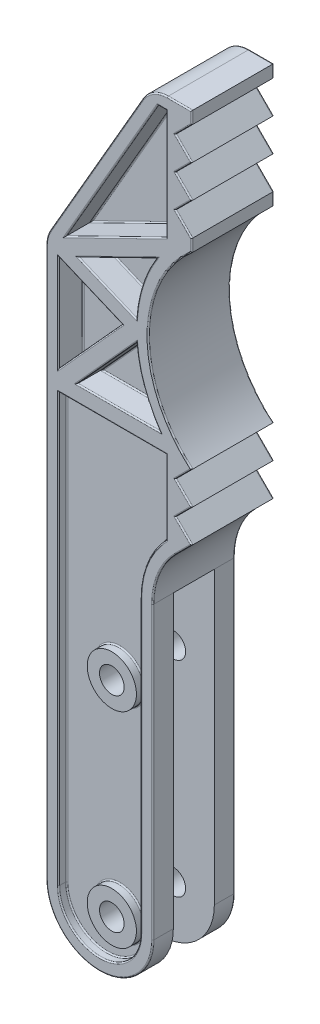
from build123d import *

# Parameters (mm, degrees)
SKETCH1_R           = 1.5000000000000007
SKETCH1_R_2         = 1.5000000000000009
BOSS_EXTRUDE1_DEPTH = 5
CUT_EXTRUDE1_DEPTH  = 2.5
CUT_EXTRUDE2_DEPTH  = 1
SKETCH4_R           = 3.000000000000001
SKETCH4_R_2         = 1.5000000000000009
SKETCH4_R_3         = 1.5000000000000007
EXTRUDE_THIN1_DEPTH = 1
CUT_EXTRUDE3_DEPTH  = 2
EXTRUDE_THIN3_REACH = 94.277
BOSS_EXTRUDE2_DEPTH = 3
FILLET1_R           = 3.5
FILLET2_R           = 0.15


with BuildPart() as part:
    # Sketch1 → Boss-Extrude1 (new, symmetric)
    with BuildSketch(Plane.XY):
        with BuildLine():
            Line((0, 88.5), (-2.000000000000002, 86.5))
            Line((-2.000000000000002, 86.5), (0, 84.49999999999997))
            Line((0, 84.49999999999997), (-1.99999999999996, 82.49999999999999))
            Line((-1.99999999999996, 82.49999999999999), (4.19e-14, 80.49999999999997))
            Line((4.19e-14, 80.49999999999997), (-1.9999999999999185, 78.49999999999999))
            Line((-1.9999999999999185, 78.49999999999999), (8.38e-14, 76.49999999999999))
            Line((8.38e-14, 76.49999999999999), (0, 75))
            ThreePointArc((0, 75), (-5.3099277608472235, 63.54999999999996), (8.38e-14, 52.10000000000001))
            Line((8.38e-14, 52.10000000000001), (-1.9999999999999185, 50.10000000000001))
            Line((-1.9999999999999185, 50.10000000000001), (4.19e-14, 48.100000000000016))
            Line((4.19e-14, 48.100000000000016), (-1.99999999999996, 46.1))
            Line((-1.99999999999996, 46.1), (0, 44.100000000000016))
            Line((0, 44.100000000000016), (-2.000000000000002, 42.1))
            ThreePointArc((-2.000000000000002, 42.1), (-4.035298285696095, 39.05396085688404), (-4.749999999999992, 35.460912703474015))
            Line((-4.749999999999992, 35.460912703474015), (-4.749999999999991, 0))
            ThreePointArc((-4.749999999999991, 0), (-11.249999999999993, -6.499999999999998), (-17.74999999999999, 0))
            Line((-17.74999999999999, 0), (-17.75, 67.91635220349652))
            Line((-17.75, 67.91635220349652), (-5.000000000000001, 90))
            Line((-5.000000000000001, 90), (0, 90))
            Line((0, 90), (0, 88.5))
        make_face()
        with Locations((-9.749999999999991, 0)):
            Circle(SKETCH1_R, mode=Mode.SUBTRACT)
        with Locations((-9.749999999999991, 25)):
            Circle(SKETCH1_R_2, mode=Mode.SUBTRACT)
    extrude(amount=BOSS_EXTRUDE1_DEPTH, both=True)

    # Sketch2 → Cut-Extrude1 (cut, symmetric)
    with BuildSketch(Plane.XY):
        with BuildLine():
            Line((-14.999999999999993, -8.410797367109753), (-14.999999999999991, 23.58920263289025))
            ThreePointArc((-14.999999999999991, 23.58920263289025), (-12.082951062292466, 31.43139620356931), (-4.749999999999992, 35.460912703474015))
            Line((-4.749999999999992, 35.460912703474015), (-4.749999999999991, 0))
            Line((-4.749999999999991, 0), (-4.74999999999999, -8.410797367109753))
            Line((-4.74999999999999, -8.410797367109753), (-14.999999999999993, -8.410797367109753))
        make_face()
    extrude(amount=CUT_EXTRUDE1_DEPTH, both=True, mode=Mode.SUBTRACT)

    # Sketch3 → Cut-Extrude2 (cut)
    with BuildSketch(Plane.XY.offset(5)):
        with BuildLine():
            Line((-3.127647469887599, 88.5), (-4.13397459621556, 88.5))
            Line((-4.13397459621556, 88.5), (-16.249999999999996, 67.51442841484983))
            Line((-16.249999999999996, 67.51442841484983), (-16.249999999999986, 0))
            ThreePointArc((-16.249999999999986, 0), (-11.24999999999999, -4.999999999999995), (-6.249999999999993, 7.2e-16))
            Line((-6.249999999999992, 6.1e-16), (-6.249999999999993, 35.460912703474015))
            ThreePointArc((-6.249999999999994, 35.460912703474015), (-5.439227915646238, 39.583992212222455), (-3.127647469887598, 43.09308495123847))
            Line((-3.127647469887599, 43.09308495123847), (-3.127647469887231, 53.15980936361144))
            ThreePointArc((-3.127647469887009, 53.159809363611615), (-6.809927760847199, 63.549999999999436), (-3.127647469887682, 73.9401906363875))
            Line((-3.1276474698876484, 73.94019063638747), (-3.127647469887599, 88.5))
        make_face()
    cut_extrude2 = extrude(amount=-CUT_EXTRUDE2_DEPTH, mode=Mode.SUBTRACT)

    # Sketch4 → Extrude-Thin1 (add)
    # profile 1 of 2: a face of its own
    with BuildSketch(Plane.XY.offset(4)):
        with Locations((-9.749999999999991, 25)):
            Circle(SKETCH4_R)
        with Locations((-9.749999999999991, 25)):
            Circle(SKETCH4_R_2, mode=Mode.SUBTRACT)
    # profile 2 of 2: a face of its own
    with BuildSketch(Plane.XY.offset(4)):
        with Locations((-9.749999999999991, 0)):
            Circle(SKETCH4_R)
        with Locations((-9.749999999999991, 0)):
            Circle(SKETCH4_R_3, mode=Mode.SUBTRACT)
    extrude_thin1 = extrude(amount=EXTRUDE_THIN1_DEPTH)

    # Sketch5 → Cut-Extrude3 (cut)
    with BuildSketch(Plane.XY.offset(4)):
        with BuildLine():
            Line((-16.25, 53.159809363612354), (-3.127647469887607, 53.159809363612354))
            ThreePointArc((-3.1276474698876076, 53.159809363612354), (-6.809927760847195, 63.54999999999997), (-3.127647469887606, 73.94019063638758))
            Line((-3.1276474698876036, 73.94019063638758), (-3.127647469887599, 88.5))
            Line((-3.127647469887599, 88.5), (-4.13397459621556, 88.5))
            Line((-4.13397459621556, 88.5), (-16.250000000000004, 67.51442841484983))
            Line((-16.250000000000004, 67.51442841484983), (-16.25, 53.159809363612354))
        make_face()
    cut_extrude3 = extrude(amount=-CUT_EXTRUDE3_DEPTH, mode=Mode.SUBTRACT)

    # Sketch7 → Extrude-Thin3 (add, up to next)
    with BuildSketch(Plane.XY.offset(5), mode=Mode.PRIVATE) as extrude_thin3_sk1:
        Polygon((-3.5674314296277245, 74.83829423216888), (-18.66641219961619, 67.44461539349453), (-8.501155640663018, 63.17564044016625), (-18.509657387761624, 52.159809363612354), (-3.1276474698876, 52.159809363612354), (-3.1276474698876, 54.159809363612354), (-13.990342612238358, 54.159809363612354), (-5.118699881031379, 63.92435955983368), (-13.833587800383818, 67.58424143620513), (-2.6878635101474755, 73.04208704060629), align=None)
    extrude_thin3_tool1 = extrude(extrude_thin3_sk1.sketch, amount=-EXTRUDE_THIN3_REACH, mode=Mode.PRIVATE) - part.part
    extrude_thin3 = extrude_thin3_tool1.solids().sort_by_distance((-10.994916, 70.892301, 5))[0]
    add(extrude_thin3)

    # Sketch8 → Boss-Extrude2 (add)
    with BuildSketch(Plane.XY.offset(5)):
        Polygon((-3.567431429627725, 74.83829423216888), (-3.127647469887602, 73.94019063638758), (-3.127647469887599, 75.0536479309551), align=None)
    boss_extrude2 = extrude(amount=-BOSS_EXTRUDE2_DEPTH)

    # Mirror2: Cut-Extrude2, Extrude-Thin1, Cut-Extrude3, Extrude-Thin3, Boss-Extrude2 across plane
    add(cut_extrude2.mirror(Plane.XY), mode=Mode.SUBTRACT)
    add(extrude_thin1.mirror(Plane.XY))
    add(cut_extrude3.mirror(Plane.XY), mode=Mode.SUBTRACT)
    add(extrude_thin3.mirror(Plane.XY))
    add(boss_extrude2.mirror(Plane.XY))

    # Fillet1
    fillet1_edges = [part.edges().sort_by_distance(p)[0] for p in [
        (-17.75, 67.91635220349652, 0),
        (-5.000000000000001, 90, 0),
    ]]
    fillet(fillet1_edges, radius=FILLET1_R)

    # Fillet2
    fillet2_edges = [part.edges().sort_by_distance(p)[0] for p in [
        (-12.749999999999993, 25, 4),
        (-12.749999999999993, -9.6e-16, 4),
        (-11.24999999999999, -6.499999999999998, 5),
        (-9.743869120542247, 78.7833776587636, 2),
        (-3.6308110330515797, 88.5, 2),
        (-5.833301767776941, 57.95760700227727, 2),
        (-6.025807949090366, 68.57604316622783, 2),
        (-16.250000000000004, 60.538360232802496, 2),
        (-4.749999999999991, 17.730456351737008, 5),
        (-16.249999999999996, 60.53836023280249, 5),
        (-16.24999999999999, 26.079904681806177, 5),
        (-16.24999999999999, 26.079904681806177, 4),
        (-3.1276474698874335, 47.62644715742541, 5),
        (-3.1276474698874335, 47.62644715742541, 4),
        (-6.025807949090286, 68.57604316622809, 5),
        (-5.833301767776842, 57.95760700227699, 5),
        (-9.087085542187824, 69.90851178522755, 2),
        (-10.304391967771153, 66.10212944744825, 2),
        (-10.369538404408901, 58.145037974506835, 2),
        (-8.933834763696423, 54.159809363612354, 2),
        (-9.6888237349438, 52.159809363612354, 4),
        (0, 89.25, -5),
        (-9.688823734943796, 52.159809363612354, 5),
        (-12.375577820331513, 58.91126787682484, 1.9999999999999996),
        (-12.375577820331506, 58.911267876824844, 5),
        (-12.375577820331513, 64.80273279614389, 1.9999999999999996),
        (-12.375577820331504, 64.8027327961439, 5),
        (-9.240705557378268, 72.06020162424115, 5),
        (-9.240705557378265, 72.06020162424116, 2),
        (-8.933834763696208, 54.159809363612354, 5),
        (-10.369538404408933, 58.1450379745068, 5),
        (-10.30439196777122, 66.10212944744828, 5),
        (-9.0870855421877, 69.9085117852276, 5),
        (-1.000000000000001, 87.5, -5),
        (-1.000000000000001, 85.49999999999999, -5),
        (-0.99999999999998, 83.49999999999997, -5),
        (-0.9999999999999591, 81.49999999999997, -5),
        (-4.035298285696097, 39.05396085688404, 5),
        (-0.9999999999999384, 79.49999999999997, -5),
        (-0.9999999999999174, 77.49999999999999, -5),
        (4.19e-14, 75.75, -5),
        (-5.3099277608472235, 63.54999999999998, -5),
        (-3.1276474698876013, 81.77682396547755, 2),
        (-0.9999999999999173, 51.10000000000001, -5),
        (-0.9999999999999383, 49.10000000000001, -5),
        (-0.999999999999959, 47.10000000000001, -5),
        (-1.000000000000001, 43.10000000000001, 5),
        (-0.99999999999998, 45.10000000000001, -5),
        (-3.6308110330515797, 88.5, -5),
        (-9.74386912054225, 78.7833776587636, -5),
        (-11.24999999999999, -4.999999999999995, -5),
        (-1.000000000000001, 43.10000000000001, -5),
        (-6.249999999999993, 17.730456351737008, -5),
        (-5.439227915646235, 39.583992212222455, -4),
        (-11.24999999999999, -4.999999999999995, -4),
        (-6.249999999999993, 17.730456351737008, -4),
        (-4.035298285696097, 39.05396085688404, -5),
        (-5.439227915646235, 39.583992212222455, -5),
        (-3.1276474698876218, 81.77682396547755, -5),
        (-4.749999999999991, 17.730456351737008, -5),
        (-11.24999999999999, -6.499999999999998, -5),
        (-12.749999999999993, 25, -4),
        (-1.4896370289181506, 90, -5),
        (-0.99999999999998, 45.10000000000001, 5),
        (-12.749999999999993, -9.6e-16, -4),
        (-3.6308110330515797, 88.5, -2),
        (-9.743869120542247, 78.7833776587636, -2),
        (-16.250000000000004, 60.538360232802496, -2),
        (-0.999999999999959, 47.10000000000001, 5),
        (-5.833301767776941, 57.95760700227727, -2),
        (-6.025807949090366, 68.57604316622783, -2),
        (-3.1276474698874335, 47.62644715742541, -4),
        (-16.24999999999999, 26.079904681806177, -4),
        (-3.1276474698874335, 47.62644715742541, -5),
        (-16.249999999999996, 60.53836023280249, -5),
        (-16.24999999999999, 26.079904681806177, -5),
        (-6.025807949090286, 68.57604316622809, -5),
        (-5.833301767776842, 57.95760700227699, -5),
        (-9.240705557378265, 72.06020162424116, -2),
        (-12.375577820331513, 64.80273279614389, -1.9999999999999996),
        (-12.375577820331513, 58.91126787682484, -1.9999999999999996),
        (-9.6888237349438, 52.159809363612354, -4),
        (-8.933834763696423, 54.159809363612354, -2),
        (-8.933834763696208, 54.159809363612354, -5),
        (-10.369538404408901, 58.145037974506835, -2),
        (-10.369538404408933, 58.1450379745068, -5),
        (-10.304391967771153, 66.10212944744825, -2),
        (-10.30439196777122, 66.10212944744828, -5),
        (-9.087085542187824, 69.90851178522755, -2),
        (-9.087085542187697, 69.9085117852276, -5),
        (-9.688823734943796, 52.159809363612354, -5),
        (-12.375577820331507, 58.911267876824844, -5),
        (-12.375577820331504, 64.8027327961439, -5),
        (-9.240705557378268, 72.06020162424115, -5),
        (-0.9999999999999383, 49.10000000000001, 5),
        (-3.1276474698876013, 81.77682396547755, -2),
        (-0.9999999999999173, 51.10000000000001, 5),
        (-11.645725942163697, 78.48926501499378, -5),
        (-11.645725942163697, 78.48926501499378, 5),
        (-17.749999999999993, 33.48926501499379, -5),
        (-17.63074039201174, 67.88439668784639, -5),
        (-4.729274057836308, 89.53108891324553, -5),
        (-17.749999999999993, 33.48926501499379, 5),
        (-17.63074039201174, 67.88439668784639, 5),
        (-4.729274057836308, 89.53108891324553, 5),
        (-5.3099277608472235, 63.54999999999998, 5),
        (-1.4896370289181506, 90, 5),
        (4.19e-14, 75.75, 5),
        (-0.9999999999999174, 77.49999999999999, 5),
        (-0.9999999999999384, 79.49999999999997, 5),
        (-0.9999999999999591, 81.49999999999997, 5),
        (-0.99999999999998, 83.49999999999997, 5),
        (-1.000000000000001, 85.49999999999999, 5),
        (-1.000000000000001, 87.5, 5),
        (0, 89.25, 5),
        (-5.439227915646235, 39.583992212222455, 5),
        (-6.249999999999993, 17.730456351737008, 4),
        (-11.24999999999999, -4.999999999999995, 4),
        (-3.1276474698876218, 81.77682396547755, 5),
        (-5.439227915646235, 39.583992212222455, 4),
        (-3.6308110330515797, 88.5, 5),
        (-9.74386912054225, 78.7833776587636, 5),
        (-11.24999999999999, -4.999999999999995, 5),
        (-6.249999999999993, 17.730456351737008, 5),
    ]]
    fillet(fillet2_edges, radius=FILLET2_R)


solid = part.part
